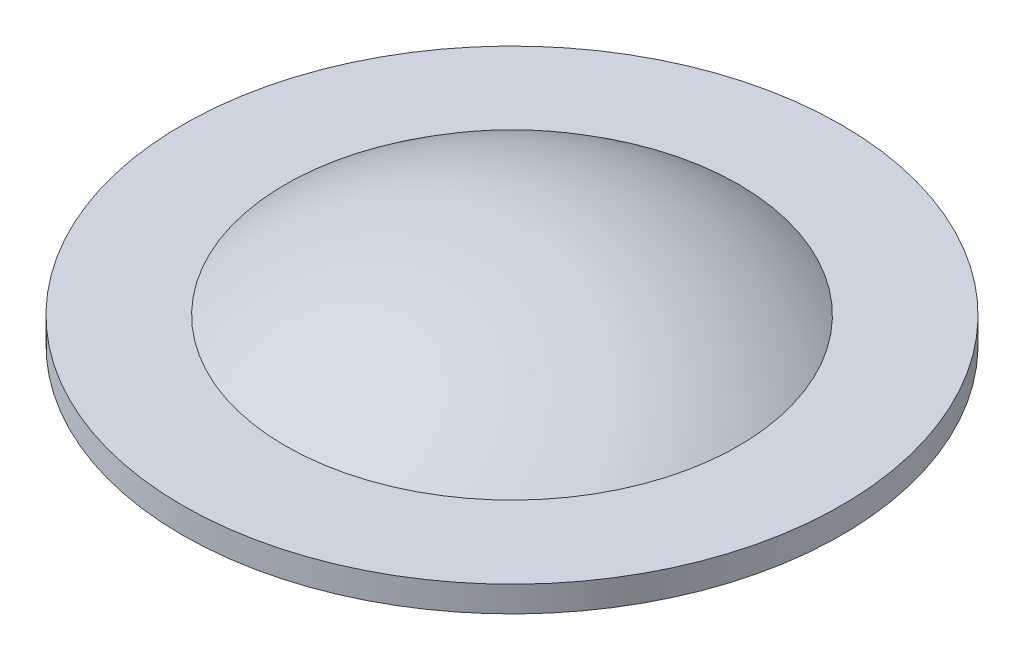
from build123d import *

# Parameters (mm, degrees)
SKETCH1_R           = 64
SKETCH1_R_2         = 44
BOSS_EXTRUDE1_DEPTH = 5
SKETCH2_R           = 44
BOSS_EXTRUDE2_DEPTH = 0.5
DOME1_FACE_RADIUS   = 44
DOME1_HEIGHT        = 15


with BuildPart() as part:
    # Sketch1 → Boss-Extrude1 (new body)
    with BuildSketch(Plane(origin=(0, 0, 0), x_dir=(1, 0, 0), z_dir=(0, 1, 0))):
        with Locations(Location((0, 0, 0), (0, 0, 270))):
            Circle(SKETCH1_R)
        with Locations(Location((0, 0, 0), (0, 0, 270))):
            Circle(SKETCH1_R_2, mode=Mode.SUBTRACT)
    extrude(amount=BOSS_EXTRUDE1_DEPTH)


with BuildPart() as body_2:
    # Sketch2 → Boss-Extrude2 (new body)
    with BuildSketch(Plane(origin=(0, 5, 0), x_dir=(1, 0, 0), z_dir=(0, 1, 0))):
        with Locations(Location((0, 0, 0), (0, 0, 270))):
            Circle(SKETCH2_R)
    extrude(amount=-BOSS_EXTRUDE2_DEPTH)

    # Dome1: a dome of height H over a round flat face of radius A is a cap of a sphere of radius (A * A + H * H) / (2 * H)
    dome1_r = (DOME1_FACE_RADIUS * DOME1_FACE_RADIUS + DOME1_HEIGHT * DOME1_HEIGHT) / (2 * DOME1_HEIGHT)
    dome1_base = Plane((0, 5, 0), z_dir=(0, 1, 0))
    with Locations(dome1_base.offset(DOME1_HEIGHT - dome1_r)):
        dome1_ball = Sphere(dome1_r, mode=Mode.PRIVATE)
    add(split(dome1_ball, bisect_by=dome1_base, keep=Keep.TOP, mode=Mode.PRIVATE))


solid = Compound([part.part, body_2.part])
